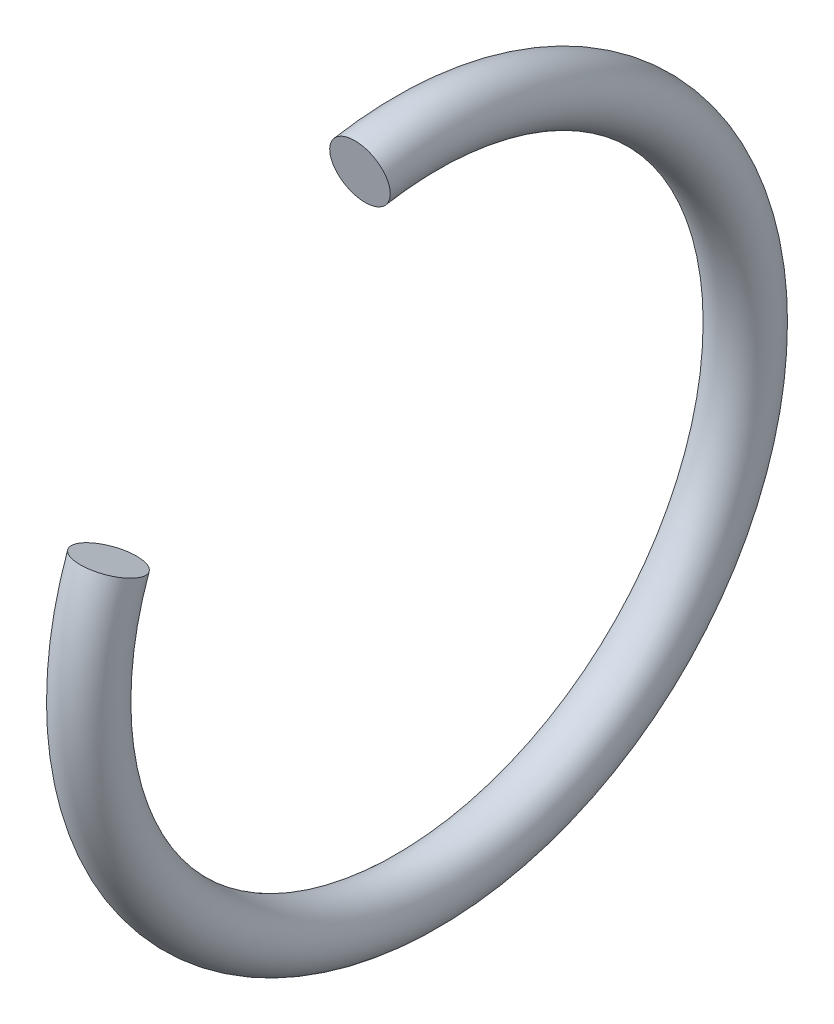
ISO-10303-21;
HEADER;
FILE_DESCRIPTION(('STEP AP214'),'2;1');
FILE_NAME('part.step','',(''),(''),'','','');
FILE_SCHEMA(('AUTOMOTIVE_DESIGN { 1 0 10303 214 1 1 1 1 }'));
ENDSEC;
DATA;
#1=APPLICATION_CONTEXT('core data for automotive mechanical design processes');
#2=APPLICATION_PROTOCOL_DEFINITION('international standard','automotive_design',2000,#1);
#3=PRODUCT_CONTEXT('',#1,'mechanical');
#4=PRODUCT('Part','Part','',(#3));
#5=PRODUCT_RELATED_PRODUCT_CATEGORY('part','',(#4));
#6=PRODUCT_DEFINITION_FORMATION('','',#4);
#7=PRODUCT_DEFINITION_CONTEXT('part definition',#1,'design');
#8=PRODUCT_DEFINITION('design','',#6,#7);
#9=PRODUCT_DEFINITION_SHAPE('','',#8);
#10=(LENGTH_UNIT() NAMED_UNIT(*) SI_UNIT(.MILLI.,.METRE.));
#11=(NAMED_UNIT(*) PLANE_ANGLE_UNIT() SI_UNIT($,.RADIAN.));
#12=(NAMED_UNIT(*) SI_UNIT($,.STERADIAN.) SOLID_ANGLE_UNIT());
#13=UNCERTAINTY_MEASURE_WITH_UNIT(LENGTH_MEASURE(1.E-05),#10,'distance_accuracy_value','');
#14=(GEOMETRIC_REPRESENTATION_CONTEXT(3) GLOBAL_UNCERTAINTY_ASSIGNED_CONTEXT((#13)) GLOBAL_UNIT_ASSIGNED_CONTEXT((#10,
#11,#12)) REPRESENTATION_CONTEXT('',''));
#15=CARTESIAN_POINT('',(0.,0.,0.));
#16=DIRECTION('',(0.,0.,1.));
#17=DIRECTION('',(1.,0.,0.));
#18=AXIS2_PLACEMENT_3D('',#15,#16,#17);
#19=CARTESIAN_POINT('',(54.4,0.,0.));
#20=DIRECTION('',(-1.,0.,0.));
#21=DIRECTION('',(0.,0.,1.));
#22=AXIS2_PLACEMENT_3D('',#19,#20,#21);
#23=TOROIDAL_SURFACE('',#22,5.5,0.499999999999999);
#24=CARTESIAN_POINT('',(54.4,5.41644264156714,0.955064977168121));
#25=DIRECTION('',(0.,-0.173648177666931,0.984807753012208));
#26=DIRECTION('',(1.,0.,0.));
#27=AXIS2_PLACEMENT_3D('',#24,#25,#26);
#28=CIRCLE('',#27,0.499999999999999);
#29=CARTESIAN_POINT('',(54.4,5.90884651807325,1.04188906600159));
#30=VERTEX_POINT('',#29);
#31=EDGE_CURVE('E10',#30,#30,#28,.T.);
#32=CARTESIAN_POINT('',(54.4,1.88111078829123,5.16830941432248));
#33=DIRECTION('',(0.,-0.939692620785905,0.342020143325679));
#34=DIRECTION('',(1.,0.,0.));
#35=AXIS2_PLACEMENT_3D('',#32,#33,#34);
#36=CIRCLE('',#35,0.499999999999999);
#37=CARTESIAN_POINT('',(54.4,2.05212085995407,5.63815572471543));
#38=VERTEX_POINT('',#37);
#39=EDGE_CURVE('E28',#38,#38,#36,.T.);
#40=CARTESIAN_POINT('',(54.4,0.,0.));
#41=DIRECTION('',(-1.,0.,0.));
#42=DIRECTION('',(0.,0.,1.));
#43=AXIS2_PLACEMENT_3D('',#40,#41,#42);
#44=CIRCLE('',#43,6.);
#45=EDGE_CURVE('',#30,#38,#44,.T.);
#46=ORIENTED_EDGE('',*,*,#31,.F.);
#47=ORIENTED_EDGE('',*,*,#39,.T.);
#48=ORIENTED_EDGE('',*,*,#45,.T.);
#49=ORIENTED_EDGE('',*,*,#45,.F.);
#50=EDGE_LOOP('',(#46,#48,#47,#49));
#51=FACE_BOUND('',#50,.T.);
#52=ADVANCED_FACE('F22',(#51),#23,.T.);
#53=CARTESIAN_POINT('',(54.4,5.41644264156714,0.955064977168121));
#54=DIRECTION('',(0.,-0.173648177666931,0.984807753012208));
#55=DIRECTION('',(1.,0.,0.));
#56=AXIS2_PLACEMENT_3D('',#53,#54,#55);
#57=PLANE('',#56);
#58=ORIENTED_EDGE('',*,*,#31,.T.);
#59=EDGE_LOOP('',(#58));
#60=FACE_BOUND('',#59,.T.);
#61=ADVANCED_FACE('F37',(#60),#57,.T.);
#62=CARTESIAN_POINT('',(54.4,1.88111078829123,5.16830941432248));
#63=DIRECTION('',(0.,-0.939692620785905,0.342020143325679));
#64=DIRECTION('',(1.,0.,0.));
#65=AXIS2_PLACEMENT_3D('',#62,#63,#64);
#66=PLANE('',#65);
#67=ORIENTED_EDGE('',*,*,#39,.F.);
#68=EDGE_LOOP('',(#67));
#69=FACE_BOUND('',#68,.T.);
#70=ADVANCED_FACE('F35',(#69),#66,.F.);
#71=CLOSED_SHELL('',(#52,#61,#70));
#72=MANIFOLD_SOLID_BREP('B2',#71);
#73=ADVANCED_BREP_SHAPE_REPRESENTATION('',(#18,#72),#14);
#74=SHAPE_DEFINITION_REPRESENTATION(#9,#73);
ENDSEC;
END-ISO-10303-21;
